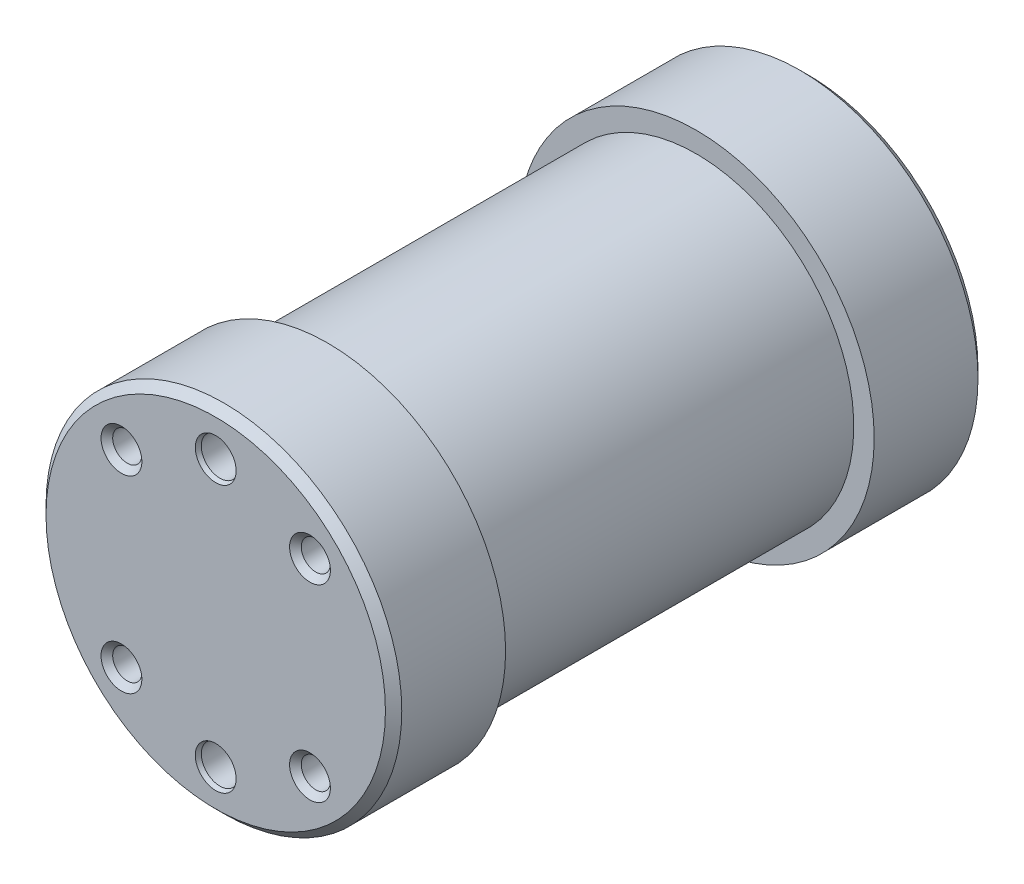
ISO-10303-21;
HEADER;
FILE_DESCRIPTION(('STEP AP214'),'2;1');
FILE_NAME('part.step','',(''),(''),'','','');
FILE_SCHEMA(('AUTOMOTIVE_DESIGN { 1 0 10303 214 1 1 1 1 }'));
ENDSEC;
DATA;
#1=APPLICATION_CONTEXT('core data for automotive mechanical design processes');
#2=APPLICATION_PROTOCOL_DEFINITION('international standard','automotive_design',2000,#1);
#3=PRODUCT_CONTEXT('',#1,'mechanical');
#4=PRODUCT('Part','Part','',(#3));
#5=PRODUCT_RELATED_PRODUCT_CATEGORY('part','',(#4));
#6=PRODUCT_DEFINITION_FORMATION('','',#4);
#7=PRODUCT_DEFINITION_CONTEXT('part definition',#1,'design');
#8=PRODUCT_DEFINITION('design','',#6,#7);
#9=PRODUCT_DEFINITION_SHAPE('','',#8);
#10=(LENGTH_UNIT() NAMED_UNIT(*) SI_UNIT(.MILLI.,.METRE.));
#11=(NAMED_UNIT(*) PLANE_ANGLE_UNIT() SI_UNIT($,.RADIAN.));
#12=(NAMED_UNIT(*) SI_UNIT($,.STERADIAN.) SOLID_ANGLE_UNIT());
#13=UNCERTAINTY_MEASURE_WITH_UNIT(LENGTH_MEASURE(1.E-05),#10,'distance_accuracy_value','');
#14=(GEOMETRIC_REPRESENTATION_CONTEXT(3) GLOBAL_UNCERTAINTY_ASSIGNED_CONTEXT((#13)) GLOBAL_UNIT_ASSIGNED_CONTEXT((#10,
#11,#12)) REPRESENTATION_CONTEXT('',''));
#15=CARTESIAN_POINT('',(0.,0.,0.));
#16=DIRECTION('',(0.,0.,1.));
#17=DIRECTION('',(1.,0.,0.));
#18=AXIS2_PLACEMENT_3D('',#15,#16,#17);
#19=CARTESIAN_POINT('',(15.25,0.,-25.4));
#20=DIRECTION('',(0.,0.,1.));
#21=DIRECTION('',(1.,0.,0.));
#22=AXIS2_PLACEMENT_3D('',#19,#20,#21);
#23=PLANE('',#22);
#24=CARTESIAN_POINT('',(0.,0.,-25.4));
#25=DIRECTION('',(0.,0.,1.));
#26=DIRECTION('',(1.,0.,0.));
#27=AXIS2_PLACEMENT_3D('',#24,#25,#26);
#28=CIRCLE('',#27,14.55);
#29=CARTESIAN_POINT('',(14.55,0.,-25.4));
#30=VERTEX_POINT('',#29);
#31=EDGE_CURVE('E205',#30,#30,#28,.F.);
#32=ORIENTED_EDGE('',*,*,#31,.T.);
#33=EDGE_LOOP('',(#32));
#34=FACE_BOUND('',#33,.T.);
#35=CARTESIAN_POINT('',(-8.08223050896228,-8.08223050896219,-25.4));
#36=DIRECTION('',(0.,0.,-1.));
#37=DIRECTION('',(-1.,0.,0.));
#38=AXIS2_PLACEMENT_3D('',#35,#36,#37);
#39=CIRCLE('',#38,1.75);
#40=CARTESIAN_POINT('',(-9.83223050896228,-8.08223050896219,-25.4));
#41=VERTEX_POINT('',#40);
#42=EDGE_CURVE('E130',#41,#41,#39,.T.);
#43=ORIENTED_EDGE('',*,*,#42,.F.);
#44=EDGE_LOOP('',(#43));
#45=FACE_BOUND('',#44,.T.);
#46=CARTESIAN_POINT('',(-8.08223050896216,8.08223050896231,-25.4));
#47=DIRECTION('',(0.,0.,-1.));
#48=DIRECTION('',(0.,1.,0.));
#49=AXIS2_PLACEMENT_3D('',#46,#47,#48);
#50=CIRCLE('',#49,1.75);
#51=CARTESIAN_POINT('',(-8.08223050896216,9.83223050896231,-25.4));
#52=VERTEX_POINT('',#51);
#53=EDGE_CURVE('E121',#52,#52,#50,.T.);
#54=ORIENTED_EDGE('',*,*,#53,.F.);
#55=EDGE_LOOP('',(#54));
#56=FACE_BOUND('',#55,.T.);
#57=CARTESIAN_POINT('',(8.08223050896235,8.08223050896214,-25.4));
#58=DIRECTION('',(0.,0.,-1.));
#59=DIRECTION('',(0.,1.,0.));
#60=AXIS2_PLACEMENT_3D('',#57,#58,#59);
#61=CIRCLE('',#60,1.75);
#62=CARTESIAN_POINT('',(8.08223050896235,9.83223050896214,-25.4));
#63=VERTEX_POINT('',#62);
#64=EDGE_CURVE('E112',#63,#63,#61,.T.);
#65=ORIENTED_EDGE('',*,*,#64,.F.);
#66=EDGE_LOOP('',(#65));
#67=FACE_BOUND('',#66,.T.);
#68=CARTESIAN_POINT('',(8.08223050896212,-8.08223050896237,-25.4));
#69=DIRECTION('',(0.,0.,-1.));
#70=DIRECTION('',(0.,1.,0.));
#71=AXIS2_PLACEMENT_3D('',#68,#69,#70);
#72=CIRCLE('',#71,1.75);
#73=CARTESIAN_POINT('',(8.08223050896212,-6.33223050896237,-25.4));
#74=VERTEX_POINT('',#73);
#75=EDGE_CURVE('E103',#74,#74,#72,.T.);
#76=ORIENTED_EDGE('',*,*,#75,.F.);
#77=EDGE_LOOP('',(#76));
#78=FACE_BOUND('',#77,.T.);
#79=CARTESIAN_POINT('',(0.,11.43,-25.4));
#80=DIRECTION('',(0.,0.,-1.));
#81=DIRECTION('',(-1.,0.,0.));
#82=AXIS2_PLACEMENT_3D('',#79,#80,#81);
#83=CIRCLE('',#82,1.75);
#84=CARTESIAN_POINT('',(-1.75,11.43,-25.4));
#85=VERTEX_POINT('',#84);
#86=EDGE_CURVE('E87',#85,#85,#83,.T.);
#87=ORIENTED_EDGE('',*,*,#86,.F.);
#88=EDGE_LOOP('',(#87));
#89=FACE_BOUND('',#88,.T.);
#90=CARTESIAN_POINT('',(0.,-11.43,-25.4));
#91=DIRECTION('',(0.,0.,-1.));
#92=DIRECTION('',(-1.,0.,0.));
#93=AXIS2_PLACEMENT_3D('',#90,#91,#92);
#94=CIRCLE('',#93,1.75);
#95=CARTESIAN_POINT('',(-1.75,-11.43,-25.4));
#96=VERTEX_POINT('',#95);
#97=EDGE_CURVE('E94',#96,#96,#94,.T.);
#98=ORIENTED_EDGE('',*,*,#97,.F.);
#99=EDGE_LOOP('',(#98));
#100=FACE_BOUND('',#99,.T.);
#101=ADVANCED_FACE('F32',(#34,#45,#56,#67,#78,#89,#100),#23,.F.);
#102=CARTESIAN_POINT('',(0.,0.,25.4));
#103=DIRECTION('',(0.,0.,-1.));
#104=DIRECTION('',(-1.,0.,0.));
#105=AXIS2_PLACEMENT_3D('',#102,#103,#104);
#106=PLANE('',#105);
#107=CARTESIAN_POINT('',(0.,-11.43,25.4));
#108=DIRECTION('',(0.,0.,1.));
#109=DIRECTION('',(1.,0.,0.));
#110=AXIS2_PLACEMENT_3D('',#107,#108,#109);
#111=CIRCLE('',#110,1.75);
#112=CARTESIAN_POINT('',(1.75,-11.43,25.4));
#113=VERTEX_POINT('',#112);
#114=EDGE_CURVE('E139',#113,#113,#111,.T.);
#115=ORIENTED_EDGE('',*,*,#114,.F.);
#116=EDGE_LOOP('',(#115));
#117=FACE_BOUND('',#116,.T.);
#118=CARTESIAN_POINT('',(0.,11.43,25.4));
#119=DIRECTION('',(0.,0.,1.));
#120=DIRECTION('',(1.,0.,0.));
#121=AXIS2_PLACEMENT_3D('',#118,#119,#120);
#122=CIRCLE('',#121,1.75);
#123=CARTESIAN_POINT('',(1.75,11.43,25.4));
#124=VERTEX_POINT('',#123);
#125=EDGE_CURVE('E148',#124,#124,#122,.T.);
#126=ORIENTED_EDGE('',*,*,#125,.F.);
#127=EDGE_LOOP('',(#126));
#128=FACE_BOUND('',#127,.T.);
#129=CARTESIAN_POINT('',(8.08223050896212,-8.08223050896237,25.4));
#130=DIRECTION('',(0.,0.,1.));
#131=DIRECTION('',(0.,-1.,0.));
#132=AXIS2_PLACEMENT_3D('',#129,#130,#131);
#133=CIRCLE('',#132,1.75);
#134=CARTESIAN_POINT('',(8.08223050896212,-9.83223050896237,25.4));
#135=VERTEX_POINT('',#134);
#136=EDGE_CURVE('E157',#135,#135,#133,.T.);
#137=ORIENTED_EDGE('',*,*,#136,.F.);
#138=EDGE_LOOP('',(#137));
#139=FACE_BOUND('',#138,.T.);
#140=CARTESIAN_POINT('',(8.08223050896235,8.08223050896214,25.4));
#141=DIRECTION('',(0.,0.,1.));
#142=DIRECTION('',(0.,-1.,0.));
#143=AXIS2_PLACEMENT_3D('',#140,#141,#142);
#144=CIRCLE('',#143,1.75);
#145=CARTESIAN_POINT('',(8.08223050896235,6.33223050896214,25.4));
#146=VERTEX_POINT('',#145);
#147=EDGE_CURVE('E166',#146,#146,#144,.T.);
#148=ORIENTED_EDGE('',*,*,#147,.F.);
#149=EDGE_LOOP('',(#148));
#150=FACE_BOUND('',#149,.T.);
#151=CARTESIAN_POINT('',(-8.08223050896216,8.08223050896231,25.4));
#152=DIRECTION('',(0.,0.,1.));
#153=DIRECTION('',(0.,-1.,0.));
#154=AXIS2_PLACEMENT_3D('',#151,#152,#153);
#155=CIRCLE('',#154,1.75);
#156=CARTESIAN_POINT('',(-8.08223050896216,6.33223050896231,25.4));
#157=VERTEX_POINT('',#156);
#158=EDGE_CURVE('E175',#157,#157,#155,.T.);
#159=ORIENTED_EDGE('',*,*,#158,.F.);
#160=EDGE_LOOP('',(#159));
#161=FACE_BOUND('',#160,.T.);
#162=CARTESIAN_POINT('',(-8.08223050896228,-8.08223050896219,25.4));
#163=DIRECTION('',(0.,0.,1.));
#164=DIRECTION('',(1.,0.,0.));
#165=AXIS2_PLACEMENT_3D('',#162,#163,#164);
#166=CIRCLE('',#165,1.75);
#167=CARTESIAN_POINT('',(-6.33223050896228,-8.08223050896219,25.4));
#168=VERTEX_POINT('',#167);
#169=EDGE_CURVE('E184',#168,#168,#166,.T.);
#170=ORIENTED_EDGE('',*,*,#169,.F.);
#171=EDGE_LOOP('',(#170));
#172=FACE_BOUND('',#171,.T.);
#173=CARTESIAN_POINT('',(0.,0.,25.4));
#174=DIRECTION('',(0.,0.,-1.));
#175=DIRECTION('',(-1.,0.,0.));
#176=AXIS2_PLACEMENT_3D('',#173,#174,#175);
#177=CIRCLE('',#176,14.55);
#178=CARTESIAN_POINT('',(-14.55,0.,25.4));
#179=VERTEX_POINT('',#178);
#180=EDGE_CURVE('E11',#179,#179,#177,.F.);
#181=ORIENTED_EDGE('',*,*,#180,.T.);
#182=EDGE_LOOP('',(#181));
#183=FACE_BOUND('',#182,.T.);
#184=ADVANCED_FACE('F230',(#117,#128,#139,#150,#161,#172,#183),#106,.F.);
#185=CARTESIAN_POINT('',(0.,0.,-25.4));
#186=DIRECTION('',(0.,0.,-1.));
#187=DIRECTION('',(-1.,0.,0.));
#188=AXIS2_PLACEMENT_3D('',#185,#186,#187);
#189=CYLINDRICAL_SURFACE('',#188,15.25);
#190=CARTESIAN_POINT('',(0.,0.,24.7));
#191=DIRECTION('',(0.,0.,-1.));
#192=DIRECTION('',(-1.,0.,0.));
#193=AXIS2_PLACEMENT_3D('',#190,#191,#192);
#194=CIRCLE('',#193,15.25);
#195=CARTESIAN_POINT('',(-15.25,0.,24.7));
#196=VERTEX_POINT('',#195);
#197=EDGE_CURVE('E40',#196,#196,#194,.T.);
#198=ORIENTED_EDGE('',*,*,#197,.T.);
#199=EDGE_LOOP('',(#198));
#200=FACE_BOUND('',#199,.T.);
#201=CARTESIAN_POINT('',(0.,0.,15.8));
#202=DIRECTION('',(0.,0.,-1.));
#203=DIRECTION('',(-1.,0.,0.));
#204=AXIS2_PLACEMENT_3D('',#201,#202,#203);
#205=CIRCLE('',#204,15.25);
#206=CARTESIAN_POINT('',(-15.25,0.,15.8));
#207=VERTEX_POINT('',#206);
#208=EDGE_CURVE('E202',#207,#207,#205,.T.);
#209=ORIENTED_EDGE('',*,*,#208,.F.);
#210=EDGE_LOOP('',(#209));
#211=FACE_BOUND('',#210,.T.);
#212=ADVANCED_FACE('F213',(#200,#211),#189,.T.);
#213=CARTESIAN_POINT('',(15.25,0.,15.8));
#214=DIRECTION('',(0.,0.,1.));
#215=DIRECTION('',(1.,0.,0.));
#216=AXIS2_PLACEMENT_3D('',#213,#214,#215);
#217=PLANE('',#216);
#218=CARTESIAN_POINT('',(0.,0.,15.8));
#219=DIRECTION('',(0.,0.,-1.));
#220=DIRECTION('',(-1.,0.,0.));
#221=AXIS2_PLACEMENT_3D('',#218,#219,#220);
#222=CIRCLE('',#221,13.5);
#223=CARTESIAN_POINT('',(-13.5,0.,15.8));
#224=VERTEX_POINT('',#223);
#225=EDGE_CURVE('E199',#224,#224,#222,.T.);
#226=ORIENTED_EDGE('',*,*,#225,.F.);
#227=EDGE_LOOP('',(#226));
#228=FACE_BOUND('',#227,.T.);
#229=ORIENTED_EDGE('',*,*,#208,.T.);
#230=EDGE_LOOP('',(#229));
#231=FACE_BOUND('',#230,.T.);
#232=ADVANCED_FACE('F242',(#228,#231),#217,.F.);
#233=CARTESIAN_POINT('',(0.,0.,-25.4));
#234=DIRECTION('',(0.,0.,-1.));
#235=DIRECTION('',(-1.,0.,0.));
#236=AXIS2_PLACEMENT_3D('',#233,#234,#235);
#237=CYLINDRICAL_SURFACE('',#236,13.5);
#238=CARTESIAN_POINT('',(0.,0.,-15.8));
#239=DIRECTION('',(0.,0.,-1.));
#240=DIRECTION('',(-1.,0.,0.));
#241=AXIS2_PLACEMENT_3D('',#238,#239,#240);
#242=CIRCLE('',#241,13.5);
#243=CARTESIAN_POINT('',(-13.5,0.,-15.8));
#244=VERTEX_POINT('',#243);
#245=EDGE_CURVE('E196',#244,#244,#242,.T.);
#246=ORIENTED_EDGE('',*,*,#245,.F.);
#247=EDGE_LOOP('',(#246));
#248=FACE_BOUND('',#247,.T.);
#249=ORIENTED_EDGE('',*,*,#225,.T.);
#250=EDGE_LOOP('',(#249));
#251=FACE_BOUND('',#250,.T.);
#252=ADVANCED_FACE('F245',(#248,#251),#237,.T.);
#253=CARTESIAN_POINT('',(13.5,0.,-15.8));
#254=DIRECTION('',(0.,0.,-1.));
#255=DIRECTION('',(-1.,0.,0.));
#256=AXIS2_PLACEMENT_3D('',#253,#254,#255);
#257=PLANE('',#256);
#258=CARTESIAN_POINT('',(0.,0.,-15.8));
#259=DIRECTION('',(0.,0.,-1.));
#260=DIRECTION('',(-1.,0.,0.));
#261=AXIS2_PLACEMENT_3D('',#258,#259,#260);
#262=CIRCLE('',#261,15.25);
#263=CARTESIAN_POINT('',(-15.25,0.,-15.8));
#264=VERTEX_POINT('',#263);
#265=EDGE_CURVE('E193',#264,#264,#262,.T.);
#266=ORIENTED_EDGE('',*,*,#265,.F.);
#267=EDGE_LOOP('',(#266));
#268=FACE_BOUND('',#267,.T.);
#269=ORIENTED_EDGE('',*,*,#245,.T.);
#270=EDGE_LOOP('',(#269));
#271=FACE_BOUND('',#270,.T.);
#272=ADVANCED_FACE('F249',(#268,#271),#257,.F.);
#273=CARTESIAN_POINT('',(0.,0.,-25.4));
#274=DIRECTION('',(0.,0.,-1.));
#275=DIRECTION('',(-1.,0.,0.));
#276=AXIS2_PLACEMENT_3D('',#273,#274,#275);
#277=CYLINDRICAL_SURFACE('',#276,15.25);
#278=CARTESIAN_POINT('',(0.,0.,-24.7));
#279=DIRECTION('',(0.,0.,1.));
#280=DIRECTION('',(1.,0.,0.));
#281=AXIS2_PLACEMENT_3D('',#278,#279,#280);
#282=CIRCLE('',#281,15.25);
#283=CARTESIAN_POINT('',(15.25,0.,-24.7));
#284=VERTEX_POINT('',#283);
#285=EDGE_CURVE('E208',#284,#284,#282,.T.);
#286=ORIENTED_EDGE('',*,*,#285,.T.);
#287=EDGE_LOOP('',(#286));
#288=FACE_BOUND('',#287,.T.);
#289=ORIENTED_EDGE('',*,*,#265,.T.);
#290=EDGE_LOOP('',(#289));
#291=FACE_BOUND('',#290,.T.);
#292=ADVANCED_FACE('F226',(#288,#291),#277,.T.);
#293=CARTESIAN_POINT('',(0.,0.,-25.4));
#294=DIRECTION('',(0.,0.,1.));
#295=DIRECTION('',(1.,0.,0.));
#296=AXIS2_PLACEMENT_3D('',#293,#294,#295);
#297=CONICAL_SURFACE('',#296,14.55,0.785398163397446);
#298=ORIENTED_EDGE('',*,*,#285,.F.);
#299=EDGE_LOOP('',(#298));
#300=FACE_BOUND('',#299,.T.);
#301=ORIENTED_EDGE('',*,*,#31,.F.);
#302=EDGE_LOOP('',(#301));
#303=FACE_BOUND('',#302,.T.);
#304=ADVANCED_FACE('F218',(#300,#303),#297,.T.);
#305=CARTESIAN_POINT('',(0.,0.,24.7));
#306=DIRECTION('',(0.,0.,-1.));
#307=DIRECTION('',(-1.,0.,0.));
#308=AXIS2_PLACEMENT_3D('',#305,#306,#307);
#309=CONICAL_SURFACE('',#308,15.25,0.785398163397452);
#310=ORIENTED_EDGE('',*,*,#180,.F.);
#311=EDGE_LOOP('',(#310));
#312=FACE_BOUND('',#311,.T.);
#313=ORIENTED_EDGE('',*,*,#197,.F.);
#314=EDGE_LOOP('',(#313));
#315=FACE_BOUND('',#314,.T.);
#316=ADVANCED_FACE('F34',(#312,#315),#309,.T.);
#317=CARTESIAN_POINT('',(-8.08223050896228,-8.08223050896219,17.4));
#318=DIRECTION('',(0.,0.,1.));
#319=DIRECTION('',(1.,0.,0.));
#320=AXIS2_PLACEMENT_3D('',#317,#318,#319);
#321=CONICAL_SURFACE('',#320,1.24999999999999,1.02974425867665);
#322=CARTESIAN_POINT('',(-8.08223050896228,-8.08223050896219,16.6489242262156));
#323=VERTEX_POINT('',#322);
#324=VERTEX_LOOP('',#323);
#325=FACE_BOUND('',#324,.T.);
#326=CARTESIAN_POINT('',(-8.08223050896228,-8.08223050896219,17.4));
#327=DIRECTION('',(0.,0.,1.));
#328=DIRECTION('',(1.,0.,0.));
#329=AXIS2_PLACEMENT_3D('',#326,#327,#328);
#330=CIRCLE('',#329,1.24999999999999);
#331=CARTESIAN_POINT('',(-6.83223050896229,-8.08223050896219,17.4));
#332=VERTEX_POINT('',#331);
#333=EDGE_CURVE('E190',#332,#332,#330,.T.);
#334=ORIENTED_EDGE('',*,*,#333,.T.);
#335=EDGE_LOOP('',(#334));
#336=FACE_BOUND('',#335,.T.);
#337=ADVANCED_FACE('F217',(#325,#336),#321,.F.);
#338=CARTESIAN_POINT('',(-8.08223050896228,-8.08223050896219,25.4));
#339=DIRECTION('',(0.,0.,1.));
#340=DIRECTION('',(1.,0.,0.));
#341=AXIS2_PLACEMENT_3D('',#338,#339,#340);
#342=CYLINDRICAL_SURFACE('',#341,1.24999999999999);
#343=ORIENTED_EDGE('',*,*,#333,.F.);
#344=EDGE_LOOP('',(#343));
#345=FACE_BOUND('',#344,.T.);
#346=CARTESIAN_POINT('',(-8.08223050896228,-8.08223050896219,24.9));
#347=DIRECTION('',(0.,0.,1.));
#348=DIRECTION('',(1.,0.,0.));
#349=AXIS2_PLACEMENT_3D('',#346,#347,#348);
#350=CIRCLE('',#349,1.25);
#351=CARTESIAN_POINT('',(-6.83223050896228,-8.08223050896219,24.9));
#352=VERTEX_POINT('',#351);
#353=EDGE_CURVE('E187',#352,#352,#350,.T.);
#354=ORIENTED_EDGE('',*,*,#353,.T.);
#355=EDGE_LOOP('',(#354));
#356=FACE_BOUND('',#355,.T.);
#357=ADVANCED_FACE('F224',(#345,#356),#342,.F.);
#358=CARTESIAN_POINT('',(-8.08223050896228,-8.08223050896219,25.4));
#359=DIRECTION('',(0.,0.,1.));
#360=DIRECTION('',(1.,0.,0.));
#361=AXIS2_PLACEMENT_3D('',#358,#359,#360);
#362=CONICAL_SURFACE('',#361,1.75,0.785398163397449);
#363=ORIENTED_EDGE('',*,*,#353,.F.);
#364=EDGE_LOOP('',(#363));
#365=FACE_BOUND('',#364,.T.);
#366=ORIENTED_EDGE('',*,*,#169,.T.);
#367=EDGE_LOOP('',(#366));
#368=FACE_BOUND('',#367,.T.);
#369=ADVANCED_FACE('F259',(#365,#368),#362,.F.);
#370=CARTESIAN_POINT('',(-8.08223050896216,8.08223050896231,17.4));
#371=DIRECTION('',(0.,0.,1.));
#372=DIRECTION('',(0.,-1.,0.));
#373=AXIS2_PLACEMENT_3D('',#370,#371,#372);
#374=CONICAL_SURFACE('',#373,1.24999999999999,1.02974425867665);
#375=CARTESIAN_POINT('',(-8.08223050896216,8.08223050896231,16.6489242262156));
#376=VERTEX_POINT('',#375);
#377=VERTEX_LOOP('',#376);
#378=FACE_BOUND('',#377,.T.);
#379=CARTESIAN_POINT('',(-8.08223050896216,8.08223050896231,17.4));
#380=DIRECTION('',(0.,0.,1.));
#381=DIRECTION('',(0.,-1.,0.));
#382=AXIS2_PLACEMENT_3D('',#379,#380,#381);
#383=CIRCLE('',#382,1.24999999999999);
#384=CARTESIAN_POINT('',(-8.08223050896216,6.83223050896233,17.4));
#385=VERTEX_POINT('',#384);
#386=EDGE_CURVE('E181',#385,#385,#383,.T.);
#387=ORIENTED_EDGE('',*,*,#386,.T.);
#388=EDGE_LOOP('',(#387));
#389=FACE_BOUND('',#388,.T.);
#390=ADVANCED_FACE('F263',(#378,#389),#374,.F.);
#391=CARTESIAN_POINT('',(-8.08223050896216,8.08223050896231,25.4));
#392=DIRECTION('',(0.,0.,1.));
#393=DIRECTION('',(0.,-1.,0.));
#394=AXIS2_PLACEMENT_3D('',#391,#392,#393);
#395=CYLINDRICAL_SURFACE('',#394,1.24999999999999);
#396=ORIENTED_EDGE('',*,*,#386,.F.);
#397=EDGE_LOOP('',(#396));
#398=FACE_BOUND('',#397,.T.);
#399=CARTESIAN_POINT('',(-8.08223050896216,8.08223050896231,24.9));
#400=DIRECTION('',(0.,0.,1.));
#401=DIRECTION('',(0.,-1.,0.));
#402=AXIS2_PLACEMENT_3D('',#399,#400,#401);
#403=CIRCLE('',#402,1.25);
#404=CARTESIAN_POINT('',(-8.08223050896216,6.83223050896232,24.9));
#405=VERTEX_POINT('',#404);
#406=EDGE_CURVE('E178',#405,#405,#403,.T.);
#407=ORIENTED_EDGE('',*,*,#406,.T.);
#408=EDGE_LOOP('',(#407));
#409=FACE_BOUND('',#408,.T.);
#410=ADVANCED_FACE('F267',(#398,#409),#395,.F.);
#411=CARTESIAN_POINT('',(-8.08223050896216,8.08223050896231,25.4));
#412=DIRECTION('',(0.,0.,1.));
#413=DIRECTION('',(0.,-1.,0.));
#414=AXIS2_PLACEMENT_3D('',#411,#412,#413);
#415=CONICAL_SURFACE('',#414,1.75,0.785398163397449);
#416=ORIENTED_EDGE('',*,*,#406,.F.);
#417=EDGE_LOOP('',(#416));
#418=FACE_BOUND('',#417,.T.);
#419=ORIENTED_EDGE('',*,*,#158,.T.);
#420=EDGE_LOOP('',(#419));
#421=FACE_BOUND('',#420,.T.);
#422=ADVANCED_FACE('F270',(#418,#421),#415,.F.);
#423=CARTESIAN_POINT('',(8.08223050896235,8.08223050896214,17.4));
#424=DIRECTION('',(0.,0.,1.));
#425=DIRECTION('',(0.,-1.,0.));
#426=AXIS2_PLACEMENT_3D('',#423,#424,#425);
#427=CONICAL_SURFACE('',#426,1.24999999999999,1.02974425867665);
#428=CARTESIAN_POINT('',(8.08223050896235,8.08223050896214,16.6489242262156));
#429=VERTEX_POINT('',#428);
#430=VERTEX_LOOP('',#429);
#431=FACE_BOUND('',#430,.T.);
#432=CARTESIAN_POINT('',(8.08223050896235,8.08223050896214,17.4));
#433=DIRECTION('',(0.,0.,1.));
#434=DIRECTION('',(0.,-1.,0.));
#435=AXIS2_PLACEMENT_3D('',#432,#433,#434);
#436=CIRCLE('',#435,1.24999999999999);
#437=CARTESIAN_POINT('',(8.08223050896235,6.83223050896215,17.4));
#438=VERTEX_POINT('',#437);
#439=EDGE_CURVE('E172',#438,#438,#436,.T.);
#440=ORIENTED_EDGE('',*,*,#439,.T.);
#441=EDGE_LOOP('',(#440));
#442=FACE_BOUND('',#441,.T.);
#443=ADVANCED_FACE('F274',(#431,#442),#427,.F.);
#444=CARTESIAN_POINT('',(8.08223050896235,8.08223050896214,25.4));
#445=DIRECTION('',(0.,0.,1.));
#446=DIRECTION('',(0.,-1.,0.));
#447=AXIS2_PLACEMENT_3D('',#444,#445,#446);
#448=CYLINDRICAL_SURFACE('',#447,1.24999999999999);
#449=ORIENTED_EDGE('',*,*,#439,.F.);
#450=EDGE_LOOP('',(#449));
#451=FACE_BOUND('',#450,.T.);
#452=CARTESIAN_POINT('',(8.08223050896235,8.08223050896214,24.9));
#453=DIRECTION('',(0.,0.,1.));
#454=DIRECTION('',(0.,-1.,0.));
#455=AXIS2_PLACEMENT_3D('',#452,#453,#454);
#456=CIRCLE('',#455,1.25);
#457=CARTESIAN_POINT('',(8.08223050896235,6.83223050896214,24.9));
#458=VERTEX_POINT('',#457);
#459=EDGE_CURVE('E169',#458,#458,#456,.T.);
#460=ORIENTED_EDGE('',*,*,#459,.T.);
#461=EDGE_LOOP('',(#460));
#462=FACE_BOUND('',#461,.T.);
#463=ADVANCED_FACE('F278',(#451,#462),#448,.F.);
#464=CARTESIAN_POINT('',(8.08223050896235,8.08223050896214,25.4));
#465=DIRECTION('',(0.,0.,1.));
#466=DIRECTION('',(0.,-1.,0.));
#467=AXIS2_PLACEMENT_3D('',#464,#465,#466);
#468=CONICAL_SURFACE('',#467,1.75,0.785398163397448);
#469=ORIENTED_EDGE('',*,*,#459,.F.);
#470=EDGE_LOOP('',(#469));
#471=FACE_BOUND('',#470,.T.);
#472=ORIENTED_EDGE('',*,*,#147,.T.);
#473=EDGE_LOOP('',(#472));
#474=FACE_BOUND('',#473,.T.);
#475=ADVANCED_FACE('F282',(#471,#474),#468,.F.);
#476=CARTESIAN_POINT('',(8.08223050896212,-8.08223050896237,17.4));
#477=DIRECTION('',(0.,0.,1.));
#478=DIRECTION('',(0.,-1.,0.));
#479=AXIS2_PLACEMENT_3D('',#476,#477,#478);
#480=CONICAL_SURFACE('',#479,1.24999999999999,1.02974425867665);
#481=CARTESIAN_POINT('',(8.08223050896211,-8.08223050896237,16.6489242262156));
#482=VERTEX_POINT('',#481);
#483=VERTEX_LOOP('',#482);
#484=FACE_BOUND('',#483,.T.);
#485=CARTESIAN_POINT('',(8.08223050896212,-8.08223050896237,17.4));
#486=DIRECTION('',(0.,0.,1.));
#487=DIRECTION('',(0.,-1.,0.));
#488=AXIS2_PLACEMENT_3D('',#485,#486,#487);
#489=CIRCLE('',#488,1.24999999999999);
#490=CARTESIAN_POINT('',(8.08223050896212,-9.33223050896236,17.4));
#491=VERTEX_POINT('',#490);
#492=EDGE_CURVE('E163',#491,#491,#489,.T.);
#493=ORIENTED_EDGE('',*,*,#492,.T.);
#494=EDGE_LOOP('',(#493));
#495=FACE_BOUND('',#494,.T.);
#496=ADVANCED_FACE('F286',(#484,#495),#480,.F.);
#497=CARTESIAN_POINT('',(8.08223050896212,-8.08223050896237,25.4));
#498=DIRECTION('',(0.,0.,1.));
#499=DIRECTION('',(0.,-1.,0.));
#500=AXIS2_PLACEMENT_3D('',#497,#498,#499);
#501=CYLINDRICAL_SURFACE('',#500,1.24999999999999);
#502=ORIENTED_EDGE('',*,*,#492,.F.);
#503=EDGE_LOOP('',(#502));
#504=FACE_BOUND('',#503,.T.);
#505=CARTESIAN_POINT('',(8.08223050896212,-8.08223050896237,24.9));
#506=DIRECTION('',(0.,0.,1.));
#507=DIRECTION('',(0.,-1.,0.));
#508=AXIS2_PLACEMENT_3D('',#505,#506,#507);
#509=CIRCLE('',#508,1.25);
#510=CARTESIAN_POINT('',(8.08223050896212,-9.33223050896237,24.9));
#511=VERTEX_POINT('',#510);
#512=EDGE_CURVE('E160',#511,#511,#509,.T.);
#513=ORIENTED_EDGE('',*,*,#512,.T.);
#514=EDGE_LOOP('',(#513));
#515=FACE_BOUND('',#514,.T.);
#516=ADVANCED_FACE('F290',(#504,#515),#501,.F.);
#517=CARTESIAN_POINT('',(8.08223050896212,-8.08223050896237,25.4));
#518=DIRECTION('',(0.,0.,1.));
#519=DIRECTION('',(0.,-1.,0.));
#520=AXIS2_PLACEMENT_3D('',#517,#518,#519);
#521=CONICAL_SURFACE('',#520,1.75,0.785398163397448);
#522=ORIENTED_EDGE('',*,*,#512,.F.);
#523=EDGE_LOOP('',(#522));
#524=FACE_BOUND('',#523,.T.);
#525=ORIENTED_EDGE('',*,*,#136,.T.);
#526=EDGE_LOOP('',(#525));
#527=FACE_BOUND('',#526,.T.);
#528=ADVANCED_FACE('F294',(#524,#527),#521,.F.);
#529=CARTESIAN_POINT('',(0.,11.43,17.4));
#530=DIRECTION('',(0.,0.,1.));
#531=DIRECTION('',(1.,0.,0.));
#532=AXIS2_PLACEMENT_3D('',#529,#530,#531);
#533=CONICAL_SURFACE('',#532,1.59999999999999,1.02974425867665);
#534=CARTESIAN_POINT('',(0.,11.43,16.4386230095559));
#535=VERTEX_POINT('',#534);
#536=VERTEX_LOOP('',#535);
#537=FACE_BOUND('',#536,.T.);
#538=CARTESIAN_POINT('',(0.,11.43,17.4));
#539=DIRECTION('',(0.,0.,1.));
#540=DIRECTION('',(1.,0.,0.));
#541=AXIS2_PLACEMENT_3D('',#538,#539,#540);
#542=CIRCLE('',#541,1.59999999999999);
#543=CARTESIAN_POINT('',(1.59999999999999,11.43,17.4));
#544=VERTEX_POINT('',#543);
#545=EDGE_CURVE('E154',#544,#544,#542,.T.);
#546=ORIENTED_EDGE('',*,*,#545,.T.);
#547=EDGE_LOOP('',(#546));
#548=FACE_BOUND('',#547,.T.);
#549=ADVANCED_FACE('F298',(#537,#548),#533,.F.);
#550=CARTESIAN_POINT('',(0.,11.43,25.4));
#551=DIRECTION('',(0.,0.,1.));
#552=DIRECTION('',(1.,0.,0.));
#553=AXIS2_PLACEMENT_3D('',#550,#551,#552);
#554=CYLINDRICAL_SURFACE('',#553,1.59999999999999);
#555=ORIENTED_EDGE('',*,*,#545,.F.);
#556=EDGE_LOOP('',(#555));
#557=FACE_BOUND('',#556,.T.);
#558=CARTESIAN_POINT('',(0.,11.43,25.037867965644));
#559=DIRECTION('',(0.,0.,1.));
#560=DIRECTION('',(1.,0.,0.));
#561=AXIS2_PLACEMENT_3D('',#558,#559,#560);
#562=CIRCLE('',#561,1.6);
#563=CARTESIAN_POINT('',(1.6,11.43,25.037867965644));
#564=VERTEX_POINT('',#563);
#565=EDGE_CURVE('E151',#564,#564,#562,.T.);
#566=ORIENTED_EDGE('',*,*,#565,.T.);
#567=EDGE_LOOP('',(#566));
#568=FACE_BOUND('',#567,.T.);
#569=ADVANCED_FACE('F302',(#557,#568),#554,.F.);
#570=CARTESIAN_POINT('',(0.,11.43,25.4));
#571=DIRECTION('',(0.,0.,1.));
#572=DIRECTION('',(1.,0.,0.));
#573=AXIS2_PLACEMENT_3D('',#570,#571,#572);
#574=CONICAL_SURFACE('',#573,1.75,0.39269908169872);
#575=ORIENTED_EDGE('',*,*,#565,.F.);
#576=EDGE_LOOP('',(#575));
#577=FACE_BOUND('',#576,.T.);
#578=ORIENTED_EDGE('',*,*,#125,.T.);
#579=EDGE_LOOP('',(#578));
#580=FACE_BOUND('',#579,.T.);
#581=ADVANCED_FACE('F306',(#577,#580),#574,.F.);
#582=CARTESIAN_POINT('',(0.,-11.43,17.4));
#583=DIRECTION('',(0.,0.,1.));
#584=DIRECTION('',(1.,0.,0.));
#585=AXIS2_PLACEMENT_3D('',#582,#583,#584);
#586=CONICAL_SURFACE('',#585,1.59999999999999,1.02974425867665);
#587=CARTESIAN_POINT('',(0.,-11.43,16.4386230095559));
#588=VERTEX_POINT('',#587);
#589=VERTEX_LOOP('',#588);
#590=FACE_BOUND('',#589,.T.);
#591=CARTESIAN_POINT('',(0.,-11.43,17.4));
#592=DIRECTION('',(0.,0.,1.));
#593=DIRECTION('',(1.,0.,0.));
#594=AXIS2_PLACEMENT_3D('',#591,#592,#593);
#595=CIRCLE('',#594,1.59999999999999);
#596=CARTESIAN_POINT('',(1.59999999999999,-11.43,17.4));
#597=VERTEX_POINT('',#596);
#598=EDGE_CURVE('E145',#597,#597,#595,.T.);
#599=ORIENTED_EDGE('',*,*,#598,.T.);
#600=EDGE_LOOP('',(#599));
#601=FACE_BOUND('',#600,.T.);
#602=ADVANCED_FACE('F310',(#590,#601),#586,.F.);
#603=CARTESIAN_POINT('',(0.,-11.43,25.4));
#604=DIRECTION('',(0.,0.,1.));
#605=DIRECTION('',(1.,0.,0.));
#606=AXIS2_PLACEMENT_3D('',#603,#604,#605);
#607=CYLINDRICAL_SURFACE('',#606,1.59999999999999);
#608=ORIENTED_EDGE('',*,*,#598,.F.);
#609=EDGE_LOOP('',(#608));
#610=FACE_BOUND('',#609,.T.);
#611=CARTESIAN_POINT('',(0.,-11.43,25.037867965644));
#612=DIRECTION('',(0.,0.,1.));
#613=DIRECTION('',(1.,0.,0.));
#614=AXIS2_PLACEMENT_3D('',#611,#612,#613);
#615=CIRCLE('',#614,1.6);
#616=CARTESIAN_POINT('',(1.6,-11.43,25.037867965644));
#617=VERTEX_POINT('',#616);
#618=EDGE_CURVE('E142',#617,#617,#615,.T.);
#619=ORIENTED_EDGE('',*,*,#618,.T.);
#620=EDGE_LOOP('',(#619));
#621=FACE_BOUND('',#620,.T.);
#622=ADVANCED_FACE('F314',(#610,#621),#607,.F.);
#623=CARTESIAN_POINT('',(0.,-11.43,25.4));
#624=DIRECTION('',(0.,0.,1.));
#625=DIRECTION('',(1.,0.,0.));
#626=AXIS2_PLACEMENT_3D('',#623,#624,#625);
#627=CONICAL_SURFACE('',#626,1.75,0.39269908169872);
#628=ORIENTED_EDGE('',*,*,#618,.F.);
#629=EDGE_LOOP('',(#628));
#630=FACE_BOUND('',#629,.T.);
#631=ORIENTED_EDGE('',*,*,#114,.T.);
#632=EDGE_LOOP('',(#631));
#633=FACE_BOUND('',#632,.T.);
#634=ADVANCED_FACE('F318',(#630,#633),#627,.F.);
#635=CARTESIAN_POINT('',(-8.08223050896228,-8.08223050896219,-17.4));
#636=DIRECTION('',(0.,0.,-1.));
#637=DIRECTION('',(-1.,0.,0.));
#638=AXIS2_PLACEMENT_3D('',#635,#636,#637);
#639=CONICAL_SURFACE('',#638,1.24999999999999,1.02974425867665);
#640=CARTESIAN_POINT('',(-8.08223050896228,-8.08223050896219,-16.6489242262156));
#641=VERTEX_POINT('',#640);
#642=VERTEX_LOOP('',#641);
#643=FACE_BOUND('',#642,.T.);
#644=CARTESIAN_POINT('',(-8.08223050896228,-8.08223050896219,-17.4));
#645=DIRECTION('',(0.,0.,-1.));
#646=DIRECTION('',(-1.,0.,0.));
#647=AXIS2_PLACEMENT_3D('',#644,#645,#646);
#648=CIRCLE('',#647,1.24999999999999);
#649=CARTESIAN_POINT('',(-9.33223050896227,-8.08223050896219,-17.4));
#650=VERTEX_POINT('',#649);
#651=EDGE_CURVE('E136',#650,#650,#648,.T.);
#652=ORIENTED_EDGE('',*,*,#651,.T.);
#653=EDGE_LOOP('',(#652));
#654=FACE_BOUND('',#653,.T.);
#655=ADVANCED_FACE('F322',(#643,#654),#639,.F.);
#656=CARTESIAN_POINT('',(-8.08223050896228,-8.08223050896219,-25.4));
#657=DIRECTION('',(0.,0.,-1.));
#658=DIRECTION('',(-1.,0.,0.));
#659=AXIS2_PLACEMENT_3D('',#656,#657,#658);
#660=CYLINDRICAL_SURFACE('',#659,1.24999999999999);
#661=ORIENTED_EDGE('',*,*,#651,.F.);
#662=EDGE_LOOP('',(#661));
#663=FACE_BOUND('',#662,.T.);
#664=CARTESIAN_POINT('',(-8.08223050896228,-8.08223050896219,-24.9));
#665=DIRECTION('',(0.,0.,-1.));
#666=DIRECTION('',(-1.,0.,0.));
#667=AXIS2_PLACEMENT_3D('',#664,#665,#666);
#668=CIRCLE('',#667,1.25);
#669=CARTESIAN_POINT('',(-9.33223050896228,-8.08223050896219,-24.9));
#670=VERTEX_POINT('',#669);
#671=EDGE_CURVE('E133',#670,#670,#668,.T.);
#672=ORIENTED_EDGE('',*,*,#671,.T.);
#673=EDGE_LOOP('',(#672));
#674=FACE_BOUND('',#673,.T.);
#675=ADVANCED_FACE('F326',(#663,#674),#660,.F.);
#676=CARTESIAN_POINT('',(-8.08223050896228,-8.08223050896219,-25.4));
#677=DIRECTION('',(0.,0.,-1.));
#678=DIRECTION('',(-1.,0.,0.));
#679=AXIS2_PLACEMENT_3D('',#676,#677,#678);
#680=CONICAL_SURFACE('',#679,1.75,0.785398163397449);
#681=ORIENTED_EDGE('',*,*,#671,.F.);
#682=EDGE_LOOP('',(#681));
#683=FACE_BOUND('',#682,.T.);
#684=ORIENTED_EDGE('',*,*,#42,.T.);
#685=EDGE_LOOP('',(#684));
#686=FACE_BOUND('',#685,.T.);
#687=ADVANCED_FACE('F330',(#683,#686),#680,.F.);
#688=CARTESIAN_POINT('',(-8.08223050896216,8.08223050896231,-17.4));
#689=DIRECTION('',(0.,0.,-1.));
#690=DIRECTION('',(0.,1.,0.));
#691=AXIS2_PLACEMENT_3D('',#688,#689,#690);
#692=CONICAL_SURFACE('',#691,1.24999999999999,1.02974425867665);
#693=CARTESIAN_POINT('',(-8.08223050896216,8.08223050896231,-16.6489242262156));
#694=VERTEX_POINT('',#693);
#695=VERTEX_LOOP('',#694);
#696=FACE_BOUND('',#695,.T.);
#697=CARTESIAN_POINT('',(-8.08223050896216,8.08223050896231,-17.4));
#698=DIRECTION('',(0.,0.,-1.));
#699=DIRECTION('',(0.,1.,0.));
#700=AXIS2_PLACEMENT_3D('',#697,#698,#699);
#701=CIRCLE('',#700,1.24999999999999);
#702=CARTESIAN_POINT('',(-8.08223050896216,9.3322305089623,-17.4));
#703=VERTEX_POINT('',#702);
#704=EDGE_CURVE('E127',#703,#703,#701,.T.);
#705=ORIENTED_EDGE('',*,*,#704,.T.);
#706=EDGE_LOOP('',(#705));
#707=FACE_BOUND('',#706,.T.);
#708=ADVANCED_FACE('F334',(#696,#707),#692,.F.);
#709=CARTESIAN_POINT('',(-8.08223050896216,8.08223050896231,-25.4));
#710=DIRECTION('',(0.,0.,-1.));
#711=DIRECTION('',(0.,1.,0.));
#712=AXIS2_PLACEMENT_3D('',#709,#710,#711);
#713=CYLINDRICAL_SURFACE('',#712,1.24999999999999);
#714=ORIENTED_EDGE('',*,*,#704,.F.);
#715=EDGE_LOOP('',(#714));
#716=FACE_BOUND('',#715,.T.);
#717=CARTESIAN_POINT('',(-8.08223050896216,8.08223050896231,-24.9));
#718=DIRECTION('',(0.,0.,-1.));
#719=DIRECTION('',(0.,1.,0.));
#720=AXIS2_PLACEMENT_3D('',#717,#718,#719);
#721=CIRCLE('',#720,1.25);
#722=CARTESIAN_POINT('',(-8.08223050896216,9.33223050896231,-24.9));
#723=VERTEX_POINT('',#722);
#724=EDGE_CURVE('E124',#723,#723,#721,.T.);
#725=ORIENTED_EDGE('',*,*,#724,.T.);
#726=EDGE_LOOP('',(#725));
#727=FACE_BOUND('',#726,.T.);
#728=ADVANCED_FACE('F338',(#716,#727),#713,.F.);
#729=CARTESIAN_POINT('',(-8.08223050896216,8.08223050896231,-25.4));
#730=DIRECTION('',(0.,0.,-1.));
#731=DIRECTION('',(0.,1.,0.));
#732=AXIS2_PLACEMENT_3D('',#729,#730,#731);
#733=CONICAL_SURFACE('',#732,1.75,0.785398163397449);
#734=ORIENTED_EDGE('',*,*,#724,.F.);
#735=EDGE_LOOP('',(#734));
#736=FACE_BOUND('',#735,.T.);
#737=ORIENTED_EDGE('',*,*,#53,.T.);
#738=EDGE_LOOP('',(#737));
#739=FACE_BOUND('',#738,.T.);
#740=ADVANCED_FACE('F342',(#736,#739),#733,.F.);
#741=CARTESIAN_POINT('',(8.08223050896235,8.08223050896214,-17.4));
#742=DIRECTION('',(0.,0.,-1.));
#743=DIRECTION('',(0.,1.,0.));
#744=AXIS2_PLACEMENT_3D('',#741,#742,#743);
#745=CONICAL_SURFACE('',#744,1.24999999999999,1.02974425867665);
#746=CARTESIAN_POINT('',(8.08223050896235,8.08223050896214,-16.6489242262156));
#747=VERTEX_POINT('',#746);
#748=VERTEX_LOOP('',#747);
#749=FACE_BOUND('',#748,.T.);
#750=CARTESIAN_POINT('',(8.08223050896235,8.08223050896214,-17.4));
#751=DIRECTION('',(0.,0.,-1.));
#752=DIRECTION('',(0.,1.,0.));
#753=AXIS2_PLACEMENT_3D('',#750,#751,#752);
#754=CIRCLE('',#753,1.24999999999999);
#755=CARTESIAN_POINT('',(8.08223050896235,9.33223050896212,-17.4));
#756=VERTEX_POINT('',#755);
#757=EDGE_CURVE('E118',#756,#756,#754,.T.);
#758=ORIENTED_EDGE('',*,*,#757,.T.);
#759=EDGE_LOOP('',(#758));
#760=FACE_BOUND('',#759,.T.);
#761=ADVANCED_FACE('F346',(#749,#760),#745,.F.);
#762=CARTESIAN_POINT('',(8.08223050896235,8.08223050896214,-25.4));
#763=DIRECTION('',(0.,0.,-1.));
#764=DIRECTION('',(0.,1.,0.));
#765=AXIS2_PLACEMENT_3D('',#762,#763,#764);
#766=CYLINDRICAL_SURFACE('',#765,1.24999999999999);
#767=ORIENTED_EDGE('',*,*,#757,.F.);
#768=EDGE_LOOP('',(#767));
#769=FACE_BOUND('',#768,.T.);
#770=CARTESIAN_POINT('',(8.08223050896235,8.08223050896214,-24.9));
#771=DIRECTION('',(0.,0.,-1.));
#772=DIRECTION('',(0.,1.,0.));
#773=AXIS2_PLACEMENT_3D('',#770,#771,#772);
#774=CIRCLE('',#773,1.25);
#775=CARTESIAN_POINT('',(8.08223050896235,9.33223050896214,-24.9));
#776=VERTEX_POINT('',#775);
#777=EDGE_CURVE('E115',#776,#776,#774,.T.);
#778=ORIENTED_EDGE('',*,*,#777,.T.);
#779=EDGE_LOOP('',(#778));
#780=FACE_BOUND('',#779,.T.);
#781=ADVANCED_FACE('F350',(#769,#780),#766,.F.);
#782=CARTESIAN_POINT('',(8.08223050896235,8.08223050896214,-25.4));
#783=DIRECTION('',(0.,0.,-1.));
#784=DIRECTION('',(0.,1.,0.));
#785=AXIS2_PLACEMENT_3D('',#782,#783,#784);
#786=CONICAL_SURFACE('',#785,1.75,0.785398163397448);
#787=ORIENTED_EDGE('',*,*,#777,.F.);
#788=EDGE_LOOP('',(#787));
#789=FACE_BOUND('',#788,.T.);
#790=ORIENTED_EDGE('',*,*,#64,.T.);
#791=EDGE_LOOP('',(#790));
#792=FACE_BOUND('',#791,.T.);
#793=ADVANCED_FACE('F354',(#789,#792),#786,.F.);
#794=CARTESIAN_POINT('',(8.08223050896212,-8.08223050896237,-17.4));
#795=DIRECTION('',(0.,0.,-1.));
#796=DIRECTION('',(0.,1.,0.));
#797=AXIS2_PLACEMENT_3D('',#794,#795,#796);
#798=CONICAL_SURFACE('',#797,1.24999999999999,1.02974425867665);
#799=CARTESIAN_POINT('',(8.08223050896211,-8.08223050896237,-16.6489242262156));
#800=VERTEX_POINT('',#799);
#801=VERTEX_LOOP('',#800);
#802=FACE_BOUND('',#801,.T.);
#803=CARTESIAN_POINT('',(8.08223050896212,-8.08223050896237,-17.4));
#804=DIRECTION('',(0.,0.,-1.));
#805=DIRECTION('',(0.,1.,0.));
#806=AXIS2_PLACEMENT_3D('',#803,#804,#805);
#807=CIRCLE('',#806,1.24999999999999);
#808=CARTESIAN_POINT('',(8.08223050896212,-6.83223050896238,-17.4));
#809=VERTEX_POINT('',#808);
#810=EDGE_CURVE('E109',#809,#809,#807,.T.);
#811=ORIENTED_EDGE('',*,*,#810,.T.);
#812=EDGE_LOOP('',(#811));
#813=FACE_BOUND('',#812,.T.);
#814=ADVANCED_FACE('F358',(#802,#813),#798,.F.);
#815=CARTESIAN_POINT('',(8.08223050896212,-8.08223050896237,-25.4));
#816=DIRECTION('',(0.,0.,-1.));
#817=DIRECTION('',(0.,1.,0.));
#818=AXIS2_PLACEMENT_3D('',#815,#816,#817);
#819=CYLINDRICAL_SURFACE('',#818,1.24999999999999);
#820=ORIENTED_EDGE('',*,*,#810,.F.);
#821=EDGE_LOOP('',(#820));
#822=FACE_BOUND('',#821,.T.);
#823=CARTESIAN_POINT('',(8.08223050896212,-8.08223050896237,-24.9));
#824=DIRECTION('',(0.,0.,-1.));
#825=DIRECTION('',(0.,1.,0.));
#826=AXIS2_PLACEMENT_3D('',#823,#824,#825);
#827=CIRCLE('',#826,1.25);
#828=CARTESIAN_POINT('',(8.08223050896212,-6.83223050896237,-24.9));
#829=VERTEX_POINT('',#828);
#830=EDGE_CURVE('E106',#829,#829,#827,.T.);
#831=ORIENTED_EDGE('',*,*,#830,.T.);
#832=EDGE_LOOP('',(#831));
#833=FACE_BOUND('',#832,.T.);
#834=ADVANCED_FACE('F362',(#822,#833),#819,.F.);
#835=CARTESIAN_POINT('',(8.08223050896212,-8.08223050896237,-25.4));
#836=DIRECTION('',(0.,0.,-1.));
#837=DIRECTION('',(0.,1.,0.));
#838=AXIS2_PLACEMENT_3D('',#835,#836,#837);
#839=CONICAL_SURFACE('',#838,1.75,0.785398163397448);
#840=ORIENTED_EDGE('',*,*,#830,.F.);
#841=EDGE_LOOP('',(#840));
#842=FACE_BOUND('',#841,.T.);
#843=ORIENTED_EDGE('',*,*,#75,.T.);
#844=EDGE_LOOP('',(#843));
#845=FACE_BOUND('',#844,.T.);
#846=ADVANCED_FACE('F366',(#842,#845),#839,.F.);
#847=CARTESIAN_POINT('',(0.,11.43,-17.4));
#848=DIRECTION('',(0.,0.,-1.));
#849=DIRECTION('',(-1.,0.,0.));
#850=AXIS2_PLACEMENT_3D('',#847,#848,#849);
#851=CONICAL_SURFACE('',#850,1.59999999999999,1.02974425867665);
#852=CARTESIAN_POINT('',(0.,11.43,-16.4386230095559));
#853=VERTEX_POINT('',#852);
#854=VERTEX_LOOP('',#853);
#855=FACE_BOUND('',#854,.T.);
#856=CARTESIAN_POINT('',(0.,11.43,-17.4));
#857=DIRECTION('',(0.,0.,-1.));
#858=DIRECTION('',(-1.,0.,0.));
#859=AXIS2_PLACEMENT_3D('',#856,#857,#858);
#860=CIRCLE('',#859,1.59999999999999);
#861=CARTESIAN_POINT('',(-1.59999999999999,11.43,-17.4));
#862=VERTEX_POINT('',#861);
#863=EDGE_CURVE('E100',#862,#862,#860,.T.);
#864=ORIENTED_EDGE('',*,*,#863,.T.);
#865=EDGE_LOOP('',(#864));
#866=FACE_BOUND('',#865,.T.);
#867=ADVANCED_FACE('F370',(#855,#866),#851,.F.);
#868=CARTESIAN_POINT('',(0.,11.43,-25.4));
#869=DIRECTION('',(0.,0.,-1.));
#870=DIRECTION('',(-1.,0.,0.));
#871=AXIS2_PLACEMENT_3D('',#868,#869,#870);
#872=CYLINDRICAL_SURFACE('',#871,1.59999999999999);
#873=ORIENTED_EDGE('',*,*,#863,.F.);
#874=EDGE_LOOP('',(#873));
#875=FACE_BOUND('',#874,.T.);
#876=CARTESIAN_POINT('',(0.,11.43,-25.037867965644));
#877=DIRECTION('',(0.,0.,-1.));
#878=DIRECTION('',(-1.,0.,0.));
#879=AXIS2_PLACEMENT_3D('',#876,#877,#878);
#880=CIRCLE('',#879,1.6);
#881=CARTESIAN_POINT('',(-1.6,11.43,-25.037867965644));
#882=VERTEX_POINT('',#881);
#883=EDGE_CURVE('E91',#882,#882,#880,.T.);
#884=ORIENTED_EDGE('',*,*,#883,.T.);
#885=EDGE_LOOP('',(#884));
#886=FACE_BOUND('',#885,.T.);
#887=ADVANCED_FACE('F374',(#875,#886),#872,.F.);
#888=CARTESIAN_POINT('',(0.,11.43,-25.4));
#889=DIRECTION('',(0.,0.,-1.));
#890=DIRECTION('',(-1.,0.,0.));
#891=AXIS2_PLACEMENT_3D('',#888,#889,#890);
#892=CONICAL_SURFACE('',#891,1.75,0.39269908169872);
#893=ORIENTED_EDGE('',*,*,#883,.F.);
#894=EDGE_LOOP('',(#893));
#895=FACE_BOUND('',#894,.T.);
#896=ORIENTED_EDGE('',*,*,#86,.T.);
#897=EDGE_LOOP('',(#896));
#898=FACE_BOUND('',#897,.T.);
#899=ADVANCED_FACE('F81',(#895,#898),#892,.F.);
#900=CARTESIAN_POINT('',(0.,-11.43,-17.4));
#901=DIRECTION('',(0.,0.,-1.));
#902=DIRECTION('',(-1.,0.,0.));
#903=AXIS2_PLACEMENT_3D('',#900,#901,#902);
#904=CONICAL_SURFACE('',#903,1.59999999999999,1.02974425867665);
#905=CARTESIAN_POINT('',(0.,-11.43,-16.4386230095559));
#906=VERTEX_POINT('',#905);
#907=VERTEX_LOOP('',#906);
#908=FACE_BOUND('',#907,.T.);
#909=CARTESIAN_POINT('',(0.,-11.43,-17.4));
#910=DIRECTION('',(0.,0.,-1.));
#911=DIRECTION('',(-1.,0.,0.));
#912=AXIS2_PLACEMENT_3D('',#909,#910,#911);
#913=CIRCLE('',#912,1.59999999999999);
#914=CARTESIAN_POINT('',(-1.59999999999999,-11.43,-17.4));
#915=VERTEX_POINT('',#914);
#916=EDGE_CURVE('E85',#915,#915,#913,.T.);
#917=ORIENTED_EDGE('',*,*,#916,.T.);
#918=EDGE_LOOP('',(#917));
#919=FACE_BOUND('',#918,.T.);
#920=ADVANCED_FACE('F77',(#908,#919),#904,.F.);
#921=CARTESIAN_POINT('',(0.,-11.43,-25.4));
#922=DIRECTION('',(0.,0.,-1.));
#923=DIRECTION('',(-1.,0.,0.));
#924=AXIS2_PLACEMENT_3D('',#921,#922,#923);
#925=CYLINDRICAL_SURFACE('',#924,1.59999999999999);
#926=ORIENTED_EDGE('',*,*,#916,.F.);
#927=EDGE_LOOP('',(#926));
#928=FACE_BOUND('',#927,.T.);
#929=CARTESIAN_POINT('',(0.,-11.43,-25.037867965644));
#930=DIRECTION('',(0.,0.,-1.));
#931=DIRECTION('',(-1.,0.,0.));
#932=AXIS2_PLACEMENT_3D('',#929,#930,#931);
#933=CIRCLE('',#932,1.6);
#934=CARTESIAN_POINT('',(-1.6,-11.43,-25.037867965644));
#935=VERTEX_POINT('',#934);
#936=EDGE_CURVE('E88',#935,#935,#933,.T.);
#937=ORIENTED_EDGE('',*,*,#936,.T.);
#938=EDGE_LOOP('',(#937));
#939=FACE_BOUND('',#938,.T.);
#940=ADVANCED_FACE('F80',(#928,#939),#925,.F.);
#941=CARTESIAN_POINT('',(0.,-11.43,-25.4));
#942=DIRECTION('',(0.,0.,-1.));
#943=DIRECTION('',(-1.,0.,0.));
#944=AXIS2_PLACEMENT_3D('',#941,#942,#943);
#945=CONICAL_SURFACE('',#944,1.75,0.39269908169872);
#946=ORIENTED_EDGE('',*,*,#936,.F.);
#947=EDGE_LOOP('',(#946));
#948=FACE_BOUND('',#947,.T.);
#949=ORIENTED_EDGE('',*,*,#97,.T.);
#950=EDGE_LOOP('',(#949));
#951=FACE_BOUND('',#950,.T.);
#952=ADVANCED_FACE('F384',(#948,#951),#945,.F.);
#953=CLOSED_SHELL('',(#101,#184,#212,#232,#252,#272,#292,#304,#316,#337,#357,#369,#390,#410,
#422,#443,#463,#475,#496,#516,#528,#549,#569,#581,#602,#622,#634,#655,#675,#687,#708,#728,#740,
#761,#781,#793,#814,#834,#846,#867,#887,#899,#920,#940,#952));
#954=MANIFOLD_SOLID_BREP('B2',#953);
#955=ADVANCED_BREP_SHAPE_REPRESENTATION('',(#18,#954),#14);
#956=SHAPE_DEFINITION_REPRESENTATION(#9,#955);
ENDSEC;
END-ISO-10303-21;
